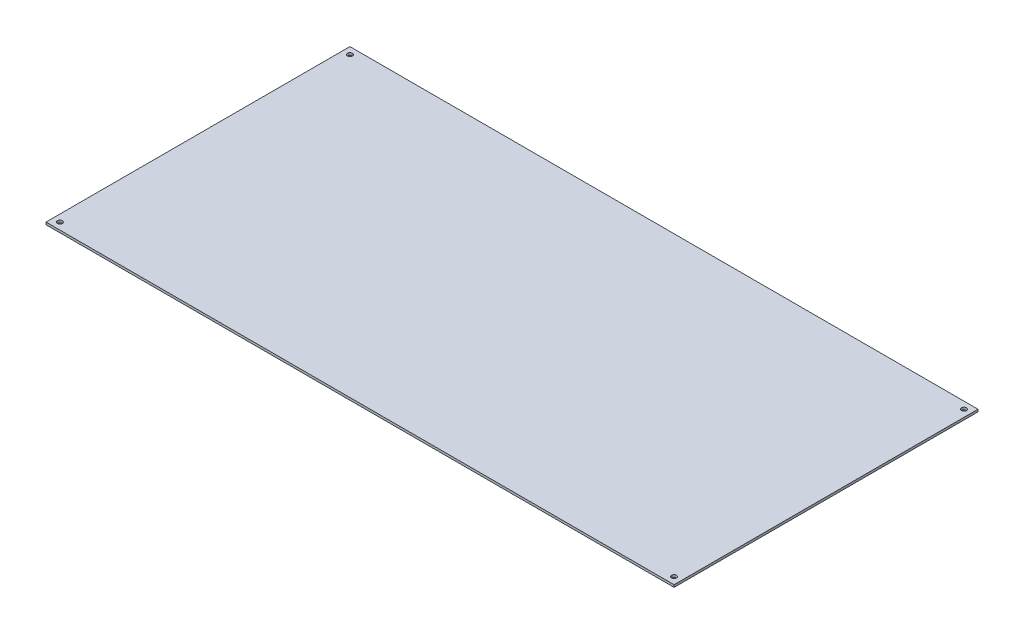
ISO-10303-21;
HEADER;
FILE_DESCRIPTION(('STEP AP214'),'2;1');
FILE_NAME('part.step','',(''),(''),'','','');
FILE_SCHEMA(('AUTOMOTIVE_DESIGN { 1 0 10303 214 1 1 1 1 }'));
ENDSEC;
DATA;
#1=APPLICATION_CONTEXT('core data for automotive mechanical design processes');
#2=APPLICATION_PROTOCOL_DEFINITION('international standard','automotive_design',2000,#1);
#3=PRODUCT_CONTEXT('',#1,'mechanical');
#4=PRODUCT('Part','Part','',(#3));
#5=PRODUCT_RELATED_PRODUCT_CATEGORY('part','',(#4));
#6=PRODUCT_DEFINITION_FORMATION('','',#4);
#7=PRODUCT_DEFINITION_CONTEXT('part definition',#1,'design');
#8=PRODUCT_DEFINITION('design','',#6,#7);
#9=PRODUCT_DEFINITION_SHAPE('','',#8);
#10=(LENGTH_UNIT() NAMED_UNIT(*) SI_UNIT(.MILLI.,.METRE.));
#11=(NAMED_UNIT(*) PLANE_ANGLE_UNIT() SI_UNIT($,.RADIAN.));
#12=(NAMED_UNIT(*) SI_UNIT($,.STERADIAN.) SOLID_ANGLE_UNIT());
#13=UNCERTAINTY_MEASURE_WITH_UNIT(LENGTH_MEASURE(1.E-05),#10,'distance_accuracy_value','');
#14=(GEOMETRIC_REPRESENTATION_CONTEXT(3) GLOBAL_UNCERTAINTY_ASSIGNED_CONTEXT((#13)) GLOBAL_UNIT_ASSIGNED_CONTEXT((#10,
#11,#12)) REPRESENTATION_CONTEXT('',''));
#15=CARTESIAN_POINT('',(0.,0.,0.));
#16=DIRECTION('',(0.,0.,1.));
#17=DIRECTION('',(1.,0.,0.));
#18=AXIS2_PLACEMENT_3D('',#15,#16,#17);
#19=CARTESIAN_POINT('',(0.,2.3622,152.4));
#20=DIRECTION('',(1.,0.,0.));
#21=DIRECTION('',(0.,0.,-1.));
#22=AXIS2_PLACEMENT_3D('',#19,#20,#21);
#23=PLANE('',#22);
#24=DIRECTION('',(0.,0.,1.));
#25=VECTOR('',#24,1.);
#26=CARTESIAN_POINT('',(0.,0.,152.4));
#27=LINE('',#26,#25);
#28=CARTESIAN_POINT('',(0.,0.,-152.4));
#29=VERTEX_POINT('',#28);
#30=CARTESIAN_POINT('',(0.,0.,152.4));
#31=VERTEX_POINT('',#30);
#32=EDGE_CURVE('E424',#29,#31,#27,.T.);
#33=ORIENTED_EDGE('',*,*,#32,.T.);
#34=DIRECTION('',(0.,-1.,0.));
#35=VECTOR('',#34,1.);
#36=CARTESIAN_POINT('',(0.,2.3622,152.4));
#37=LINE('',#36,#35);
#38=CARTESIAN_POINT('',(0.,2.3622,152.4));
#39=VERTEX_POINT('',#38);
#40=EDGE_CURVE('E11',#39,#31,#37,.T.);
#41=ORIENTED_EDGE('',*,*,#40,.F.);
#42=DIRECTION('',(0.,0.,1.));
#43=VECTOR('',#42,1.);
#44=CARTESIAN_POINT('',(0.,2.3622,152.4));
#45=LINE('',#44,#43);
#46=CARTESIAN_POINT('',(0.,2.3622,-152.4));
#47=VERTEX_POINT('',#46);
#48=EDGE_CURVE('E447',#47,#39,#45,.T.);
#49=ORIENTED_EDGE('',*,*,#48,.F.);
#50=DIRECTION('',(0.,-1.,0.));
#51=VECTOR('',#50,1.);
#52=CARTESIAN_POINT('',(0.,2.3622,-152.4));
#53=LINE('',#52,#51);
#54=EDGE_CURVE('E436',#47,#29,#53,.T.);
#55=ORIENTED_EDGE('',*,*,#54,.T.);
#56=EDGE_LOOP('',(#33,#41,#49,#55));
#57=FACE_BOUND('',#56,.T.);
#58=ADVANCED_FACE('F380',(#57),#23,.F.);
#59=CARTESIAN_POINT('',(0.,2.3622,152.4));
#60=DIRECTION('',(0.,0.,-1.));
#61=DIRECTION('',(-1.,0.,0.));
#62=AXIS2_PLACEMENT_3D('',#59,#60,#61);
#63=PLANE('',#62);
#64=DIRECTION('',(1.,0.,0.));
#65=VECTOR('',#64,1.);
#66=CARTESIAN_POINT('',(0.,0.,152.4));
#67=LINE('',#66,#65);
#68=CARTESIAN_POINT('',(629.92,0.,152.4));
#69=VERTEX_POINT('',#68);
#70=EDGE_CURVE('E420',#31,#69,#67,.T.);
#71=ORIENTED_EDGE('',*,*,#70,.T.);
#72=DIRECTION('',(0.,-1.,0.));
#73=VECTOR('',#72,1.);
#74=CARTESIAN_POINT('',(629.92,2.3622,152.4));
#75=LINE('',#74,#73);
#76=CARTESIAN_POINT('',(629.92,2.3622,152.4));
#77=VERTEX_POINT('',#76);
#78=EDGE_CURVE('E387',#77,#69,#75,.T.);
#79=ORIENTED_EDGE('',*,*,#78,.F.);
#80=DIRECTION('',(1.,0.,0.));
#81=VECTOR('',#80,1.);
#82=CARTESIAN_POINT('',(0.,2.3622,152.4));
#83=LINE('',#82,#81);
#84=EDGE_CURVE('E432',#39,#77,#83,.T.);
#85=ORIENTED_EDGE('',*,*,#84,.F.);
#86=ORIENTED_EDGE('',*,*,#40,.T.);
#87=EDGE_LOOP('',(#71,#79,#85,#86));
#88=FACE_BOUND('',#87,.T.);
#89=ADVANCED_FACE('F431',(#88),#63,.F.);
#90=CARTESIAN_POINT('',(629.92,2.3622,152.4));
#91=DIRECTION('',(-1.,0.,0.));
#92=DIRECTION('',(0.,0.,1.));
#93=AXIS2_PLACEMENT_3D('',#90,#91,#92);
#94=PLANE('',#93);
#95=DIRECTION('',(0.,0.,-1.));
#96=VECTOR('',#95,1.);
#97=CARTESIAN_POINT('',(629.92,0.,152.4));
#98=LINE('',#97,#96);
#99=CARTESIAN_POINT('',(629.92,0.,-152.4));
#100=VERTEX_POINT('',#99);
#101=EDGE_CURVE('E425',#69,#100,#98,.T.);
#102=ORIENTED_EDGE('',*,*,#101,.T.);
#103=DIRECTION('',(0.,-1.,0.));
#104=VECTOR('',#103,1.);
#105=CARTESIAN_POINT('',(629.92,2.3622,-152.4));
#106=LINE('',#105,#104);
#107=CARTESIAN_POINT('',(629.92,2.3622,-152.4));
#108=VERTEX_POINT('',#107);
#109=EDGE_CURVE('E453',#108,#100,#106,.T.);
#110=ORIENTED_EDGE('',*,*,#109,.F.);
#111=DIRECTION('',(0.,0.,-1.));
#112=VECTOR('',#111,1.);
#113=CARTESIAN_POINT('',(629.92,2.3622,152.4));
#114=LINE('',#113,#112);
#115=EDGE_CURVE('E399',#77,#108,#114,.T.);
#116=ORIENTED_EDGE('',*,*,#115,.F.);
#117=ORIENTED_EDGE('',*,*,#78,.T.);
#118=EDGE_LOOP('',(#102,#110,#116,#117));
#119=FACE_BOUND('',#118,.T.);
#120=ADVANCED_FACE('F456',(#119),#94,.F.);
#121=CARTESIAN_POINT('',(0.,2.3622,-152.4));
#122=DIRECTION('',(0.,0.,1.));
#123=DIRECTION('',(1.,0.,0.));
#124=AXIS2_PLACEMENT_3D('',#121,#122,#123);
#125=PLANE('',#124);
#126=DIRECTION('',(-1.,0.,0.));
#127=VECTOR('',#126,1.);
#128=CARTESIAN_POINT('',(0.,0.,-152.4));
#129=LINE('',#128,#127);
#130=EDGE_CURVE('E445',#100,#29,#129,.T.);
#131=ORIENTED_EDGE('',*,*,#130,.T.);
#132=ORIENTED_EDGE('',*,*,#54,.F.);
#133=DIRECTION('',(-1.,0.,0.));
#134=VECTOR('',#133,1.);
#135=CARTESIAN_POINT('',(0.,2.3622,-152.4));
#136=LINE('',#135,#134);
#137=EDGE_CURVE('E394',#108,#47,#136,.T.);
#138=ORIENTED_EDGE('',*,*,#137,.F.);
#139=ORIENTED_EDGE('',*,*,#109,.T.);
#140=EDGE_LOOP('',(#131,#132,#138,#139));
#141=FACE_BOUND('',#140,.T.);
#142=ADVANCED_FACE('F458',(#141),#125,.F.);
#143=CARTESIAN_POINT('',(0.,2.3622,-152.4));
#144=DIRECTION('',(0.,-1.,0.));
#145=DIRECTION('',(0.,0.,-1.));
#146=AXIS2_PLACEMENT_3D('',#143,#144,#145);
#147=PLANE('',#146);
#148=CARTESIAN_POINT('',(622.935,2.3622,-145.415));
#149=DIRECTION('',(0.,1.,0.));
#150=DIRECTION('',(0.,0.,1.));
#151=AXIS2_PLACEMENT_3D('',#148,#149,#150);
#152=CIRCLE('',#151,2.48919999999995);
#153=CARTESIAN_POINT('',(622.935,2.3622,-142.9258));
#154=VERTEX_POINT('',#153);
#155=EDGE_CURVE('E531',#154,#154,#152,.T.);
#156=ORIENTED_EDGE('',*,*,#155,.F.);
#157=EDGE_LOOP('',(#156));
#158=FACE_BOUND('',#157,.T.);
#159=CARTESIAN_POINT('',(622.935,2.3622,145.415));
#160=DIRECTION('',(0.,1.,0.));
#161=DIRECTION('',(0.,0.,1.));
#162=AXIS2_PLACEMENT_3D('',#159,#160,#161);
#163=CIRCLE('',#162,2.48919999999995);
#164=CARTESIAN_POINT('',(622.935,2.3622,147.9042));
#165=VERTEX_POINT('',#164);
#166=EDGE_CURVE('E533',#165,#165,#163,.T.);
#167=ORIENTED_EDGE('',*,*,#166,.F.);
#168=EDGE_LOOP('',(#167));
#169=FACE_BOUND('',#168,.T.);
#170=CARTESIAN_POINT('',(6.98500000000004,2.3622,145.415));
#171=DIRECTION('',(0.,1.,0.));
#172=DIRECTION('',(0.,0.,1.));
#173=AXIS2_PLACEMENT_3D('',#170,#171,#172);
#174=CIRCLE('',#173,2.4892);
#175=CARTESIAN_POINT('',(6.98500000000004,2.3622,147.9042));
#176=VERTEX_POINT('',#175);
#177=EDGE_CURVE('E541',#176,#176,#174,.T.);
#178=ORIENTED_EDGE('',*,*,#177,.F.);
#179=EDGE_LOOP('',(#178));
#180=FACE_BOUND('',#179,.T.);
#181=CARTESIAN_POINT('',(6.98500000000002,2.3622,-145.415));
#182=DIRECTION('',(0.,1.,0.));
#183=DIRECTION('',(0.,0.,1.));
#184=AXIS2_PLACEMENT_3D('',#181,#182,#183);
#185=CIRCLE('',#184,2.4892);
#186=CARTESIAN_POINT('',(6.98500000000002,2.3622,-142.9258));
#187=VERTEX_POINT('',#186);
#188=EDGE_CURVE('E440',#187,#187,#185,.T.);
#189=ORIENTED_EDGE('',*,*,#188,.F.);
#190=EDGE_LOOP('',(#189));
#191=FACE_BOUND('',#190,.T.);
#192=ORIENTED_EDGE('',*,*,#48,.T.);
#193=ORIENTED_EDGE('',*,*,#84,.T.);
#194=ORIENTED_EDGE('',*,*,#115,.T.);
#195=ORIENTED_EDGE('',*,*,#137,.T.);
#196=EDGE_LOOP('',(#192,#193,#194,#195));
#197=FACE_BOUND('',#196,.T.);
#198=ADVANCED_FACE('F459',(#158,#169,#180,#191,#197),#147,.F.);
#199=CARTESIAN_POINT('',(0.,0.,-152.4));
#200=DIRECTION('',(0.,-1.,0.));
#201=DIRECTION('',(0.,0.,-1.));
#202=AXIS2_PLACEMENT_3D('',#199,#200,#201);
#203=PLANE('',#202);
#204=CARTESIAN_POINT('',(622.935,0.,-145.415));
#205=DIRECTION('',(0.,1.,0.));
#206=DIRECTION('',(0.,0.,1.));
#207=AXIS2_PLACEMENT_3D('',#204,#205,#206);
#208=CIRCLE('',#207,2.48919999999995);
#209=CARTESIAN_POINT('',(622.935,0.,-142.9258));
#210=VERTEX_POINT('',#209);
#211=EDGE_CURVE('E529',#210,#210,#208,.T.);
#212=ORIENTED_EDGE('',*,*,#211,.T.);
#213=EDGE_LOOP('',(#212));
#214=FACE_BOUND('',#213,.T.);
#215=CARTESIAN_POINT('',(622.935,0.,145.415));
#216=DIRECTION('',(0.,1.,0.));
#217=DIRECTION('',(0.,0.,1.));
#218=AXIS2_PLACEMENT_3D('',#215,#216,#217);
#219=CIRCLE('',#218,2.48919999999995);
#220=CARTESIAN_POINT('',(622.935,0.,147.9042));
#221=VERTEX_POINT('',#220);
#222=EDGE_CURVE('E538',#221,#221,#219,.T.);
#223=ORIENTED_EDGE('',*,*,#222,.T.);
#224=EDGE_LOOP('',(#223));
#225=FACE_BOUND('',#224,.T.);
#226=CARTESIAN_POINT('',(6.98500000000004,0.,145.415));
#227=DIRECTION('',(0.,1.,0.));
#228=DIRECTION('',(0.,0.,1.));
#229=AXIS2_PLACEMENT_3D('',#226,#227,#228);
#230=CIRCLE('',#229,2.4892);
#231=CARTESIAN_POINT('',(6.98500000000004,0.,147.9042));
#232=VERTEX_POINT('',#231);
#233=EDGE_CURVE('E544',#232,#232,#230,.T.);
#234=ORIENTED_EDGE('',*,*,#233,.T.);
#235=EDGE_LOOP('',(#234));
#236=FACE_BOUND('',#235,.T.);
#237=CARTESIAN_POINT('',(6.98500000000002,0.,-145.415));
#238=DIRECTION('',(0.,1.,0.));
#239=DIRECTION('',(0.,0.,1.));
#240=AXIS2_PLACEMENT_3D('',#237,#238,#239);
#241=CIRCLE('',#240,2.4892);
#242=CARTESIAN_POINT('',(6.98500000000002,0.,-142.9258));
#243=VERTEX_POINT('',#242);
#244=EDGE_CURVE('E437',#243,#243,#241,.T.);
#245=ORIENTED_EDGE('',*,*,#244,.T.);
#246=EDGE_LOOP('',(#245));
#247=FACE_BOUND('',#246,.T.);
#248=ORIENTED_EDGE('',*,*,#32,.F.);
#249=ORIENTED_EDGE('',*,*,#130,.F.);
#250=ORIENTED_EDGE('',*,*,#101,.F.);
#251=ORIENTED_EDGE('',*,*,#70,.F.);
#252=EDGE_LOOP('',(#248,#249,#250,#251));
#253=FACE_BOUND('',#252,.T.);
#254=ADVANCED_FACE('F421',(#214,#225,#236,#247,#253),#203,.T.);
#255=CARTESIAN_POINT('',(6.98500000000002,0.,-145.415));
#256=DIRECTION('',(0.,1.,0.));
#257=DIRECTION('',(0.,0.,1.));
#258=AXIS2_PLACEMENT_3D('',#255,#256,#257);
#259=CYLINDRICAL_SURFACE('',#258,2.4892);
#260=ORIENTED_EDGE('',*,*,#244,.F.);
#261=EDGE_LOOP('',(#260));
#262=FACE_BOUND('',#261,.T.);
#263=ORIENTED_EDGE('',*,*,#188,.T.);
#264=EDGE_LOOP('',(#263));
#265=FACE_BOUND('',#264,.T.);
#266=ADVANCED_FACE('F467',(#262,#265),#259,.F.);
#267=CARTESIAN_POINT('',(6.98500000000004,0.,145.415));
#268=DIRECTION('',(0.,1.,0.));
#269=DIRECTION('',(0.,0.,1.));
#270=AXIS2_PLACEMENT_3D('',#267,#268,#269);
#271=CYLINDRICAL_SURFACE('',#270,2.4892);
#272=ORIENTED_EDGE('',*,*,#233,.F.);
#273=EDGE_LOOP('',(#272));
#274=FACE_BOUND('',#273,.T.);
#275=ORIENTED_EDGE('',*,*,#177,.T.);
#276=EDGE_LOOP('',(#275));
#277=FACE_BOUND('',#276,.T.);
#278=ADVANCED_FACE('F500',(#274,#277),#271,.F.);
#279=CARTESIAN_POINT('',(622.935,0.,145.415));
#280=DIRECTION('',(0.,1.,0.));
#281=DIRECTION('',(0.,0.,1.));
#282=AXIS2_PLACEMENT_3D('',#279,#280,#281);
#283=CYLINDRICAL_SURFACE('',#282,2.48919999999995);
#284=ORIENTED_EDGE('',*,*,#222,.F.);
#285=EDGE_LOOP('',(#284));
#286=FACE_BOUND('',#285,.T.);
#287=ORIENTED_EDGE('',*,*,#166,.T.);
#288=EDGE_LOOP('',(#287));
#289=FACE_BOUND('',#288,.T.);
#290=ADVANCED_FACE('F508',(#286,#289),#283,.F.);
#291=CARTESIAN_POINT('',(622.935,0.,-145.415));
#292=DIRECTION('',(0.,1.,0.));
#293=DIRECTION('',(0.,0.,1.));
#294=AXIS2_PLACEMENT_3D('',#291,#292,#293);
#295=CYLINDRICAL_SURFACE('',#294,2.48919999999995);
#296=ORIENTED_EDGE('',*,*,#211,.F.);
#297=EDGE_LOOP('',(#296));
#298=FACE_BOUND('',#297,.T.);
#299=ORIENTED_EDGE('',*,*,#155,.T.);
#300=EDGE_LOOP('',(#299));
#301=FACE_BOUND('',#300,.T.);
#302=ADVANCED_FACE('F516',(#298,#301),#295,.F.);
#303=CLOSED_SHELL('',(#58,#89,#120,#142,#198,#254,#266,#278,#290,#302));
#304=MANIFOLD_SOLID_BREP('B2',#303);
#305=ADVANCED_BREP_SHAPE_REPRESENTATION('',(#18,#304),#14);
#306=SHAPE_DEFINITION_REPRESENTATION(#9,#305);
ENDSEC;
END-ISO-10303-21;
